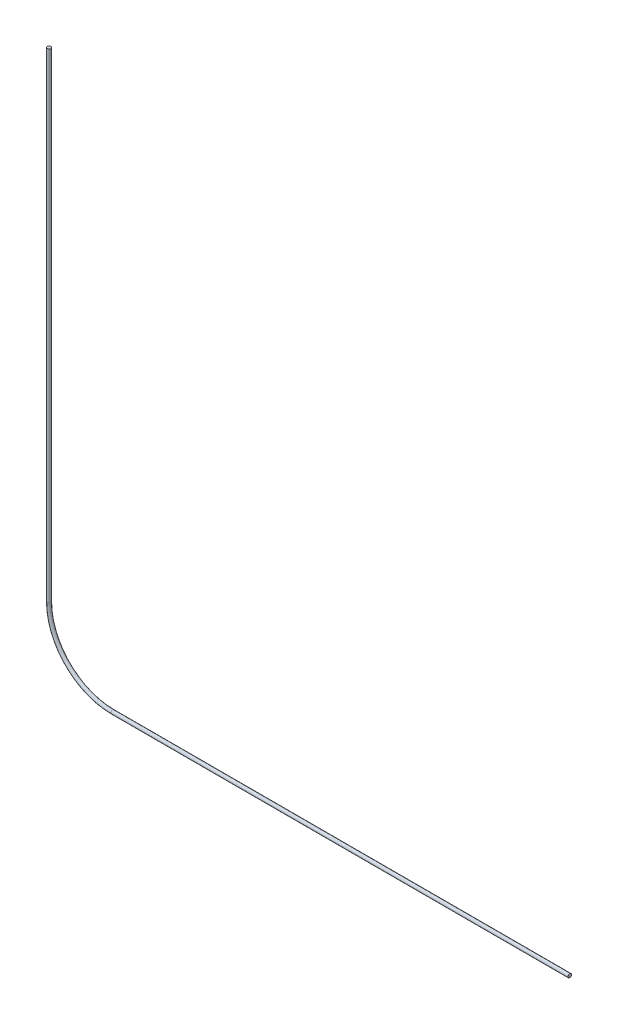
ISO-10303-21;
HEADER;
FILE_DESCRIPTION(('STEP AP214'),'2;1');
FILE_NAME('part.step','',(''),(''),'','','');
FILE_SCHEMA(('AUTOMOTIVE_DESIGN { 1 0 10303 214 1 1 1 1 }'));
ENDSEC;
DATA;
#1=APPLICATION_CONTEXT('core data for automotive mechanical design processes');
#2=APPLICATION_PROTOCOL_DEFINITION('international standard','automotive_design',2000,#1);
#3=PRODUCT_CONTEXT('',#1,'mechanical');
#4=PRODUCT('Part','Part','',(#3));
#5=PRODUCT_RELATED_PRODUCT_CATEGORY('part','',(#4));
#6=PRODUCT_DEFINITION_FORMATION('','',#4);
#7=PRODUCT_DEFINITION_CONTEXT('part definition',#1,'design');
#8=PRODUCT_DEFINITION('design','',#6,#7);
#9=PRODUCT_DEFINITION_SHAPE('','',#8);
#10=(LENGTH_UNIT() NAMED_UNIT(*) SI_UNIT(.MILLI.,.METRE.));
#11=(NAMED_UNIT(*) PLANE_ANGLE_UNIT() SI_UNIT($,.RADIAN.));
#12=(NAMED_UNIT(*) SI_UNIT($,.STERADIAN.) SOLID_ANGLE_UNIT());
#13=UNCERTAINTY_MEASURE_WITH_UNIT(LENGTH_MEASURE(1.E-05),#10,'distance_accuracy_value','');
#14=(GEOMETRIC_REPRESENTATION_CONTEXT(3) GLOBAL_UNCERTAINTY_ASSIGNED_CONTEXT((#13)) GLOBAL_UNIT_ASSIGNED_CONTEXT((#10,
#11,#12)) REPRESENTATION_CONTEXT('',''));
#15=CARTESIAN_POINT('',(0.,0.,0.));
#16=DIRECTION('',(0.,0.,1.));
#17=DIRECTION('',(1.,0.,0.));
#18=AXIS2_PLACEMENT_3D('',#15,#16,#17);
#19=CARTESIAN_POINT('',(0.,0.,0.));
#20=DIRECTION('',(1.,0.,0.));
#21=DIRECTION('',(0.,0.,-1.));
#22=AXIS2_PLACEMENT_3D('',#19,#20,#21);
#23=PLANE('',#22);
#24=CARTESIAN_POINT('',(0.,0.,0.));
#25=DIRECTION('',(1.,0.,0.));
#26=DIRECTION('',(0.,0.,-1.));
#27=AXIS2_PLACEMENT_3D('',#24,#25,#26);
#28=CIRCLE('',#27,0.18);
#29=CARTESIAN_POINT('',(0.,0.,-0.18));
#30=VERTEX_POINT('',#29);
#31=EDGE_CURVE('E56',#30,#30,#28,.T.);
#32=ORIENTED_EDGE('',*,*,#31,.T.);
#33=EDGE_LOOP('',(#32));
#34=FACE_BOUND('',#33,.T.);
#35=ADVANCED_FACE('F41',(#34),#23,.T.);
#36=CARTESIAN_POINT('',(-52.0624999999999,54.3502916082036,0.));
#37=DIRECTION('',(0.,-1.,0.));
#38=DIRECTION('',(0.,0.,-1.));
#39=AXIS2_PLACEMENT_3D('',#36,#37,#38);
#40=PLANE('',#39);
#41=CARTESIAN_POINT('',(-52.0624999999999,54.3502916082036,0.));
#42=DIRECTION('',(0.,-1.,0.));
#43=DIRECTION('',(0.,0.,-1.));
#44=AXIS2_PLACEMENT_3D('',#41,#42,#43);
#45=CIRCLE('',#44,0.18);
#46=CARTESIAN_POINT('',(-52.0624999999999,54.3502916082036,-0.18));
#47=VERTEX_POINT('',#46);
#48=EDGE_CURVE('E11',#47,#47,#45,.T.);
#49=ORIENTED_EDGE('',*,*,#48,.F.);
#50=EDGE_LOOP('',(#49));
#51=FACE_BOUND('',#50,.T.);
#52=ADVANCED_FACE('F62',(#51),#40,.F.);
#53=CARTESIAN_POINT('',(0.,0.,0.));
#54=DIRECTION('',(-1.,0.,0.));
#55=DIRECTION('',(0.,-1.,0.));
#56=AXIS2_PLACEMENT_3D('',#53,#54,#55);
#57=CYLINDRICAL_SURFACE('',#56,0.18);
#58=CARTESIAN_POINT('',(-45.6999999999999,0.,0.));
#59=DIRECTION('',(1.,0.,0.));
#60=DIRECTION('',(0.,0.,-1.));
#61=AXIS2_PLACEMENT_3D('',#58,#59,#60);
#62=CIRCLE('',#61,0.18);
#63=CARTESIAN_POINT('',(-45.6999999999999,-0.180000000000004,0.));
#64=VERTEX_POINT('',#63);
#65=EDGE_CURVE('E87',#64,#64,#62,.T.);
#66=ORIENTED_EDGE('',*,*,#65,.T.);
#67=EDGE_LOOP('',(#66));
#68=FACE_BOUND('',#67,.T.);
#69=ORIENTED_EDGE('',*,*,#31,.F.);
#70=EDGE_LOOP('',(#69));
#71=FACE_BOUND('',#70,.T.);
#72=ADVANCED_FACE('F64',(#68,#71),#57,.T.);
#73=CARTESIAN_POINT('',(-45.6999999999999,6.36249999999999,0.));
#74=DIRECTION('',(0.,0.,-1.));
#75=DIRECTION('',(-1.,0.,0.));
#76=AXIS2_PLACEMENT_3D('',#73,#74,#75);
#77=TOROIDAL_SURFACE('',#76,6.36249999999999,0.18);
#78=CARTESIAN_POINT('',(-52.0624999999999,6.36249999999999,0.));
#79=DIRECTION('',(0.,-1.,0.));
#80=DIRECTION('',(0.,0.,-1.));
#81=AXIS2_PLACEMENT_3D('',#78,#79,#80);
#82=CIRCLE('',#81,0.18);
#83=CARTESIAN_POINT('',(-52.2424999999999,6.36249999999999,0.));
#84=VERTEX_POINT('',#83);
#85=EDGE_CURVE('E49',#84,#84,#82,.T.);
#86=CARTESIAN_POINT('',(-45.6999999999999,6.36249999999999,0.));
#87=DIRECTION('',(0.,0.,-1.));
#88=DIRECTION('',(-1.,0.,0.));
#89=AXIS2_PLACEMENT_3D('',#86,#87,#88);
#90=CIRCLE('',#89,6.54249999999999);
#91=EDGE_CURVE('',#64,#84,#90,.T.);
#92=ORIENTED_EDGE('',*,*,#65,.F.);
#93=ORIENTED_EDGE('',*,*,#85,.T.);
#94=ORIENTED_EDGE('',*,*,#91,.T.);
#95=ORIENTED_EDGE('',*,*,#91,.F.);
#96=EDGE_LOOP('',(#92,#94,#93,#95));
#97=FACE_BOUND('',#96,.T.);
#98=ADVANCED_FACE('F69',(#97),#77,.T.);
#99=CARTESIAN_POINT('',(-52.0624999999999,6.36249999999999,0.));
#100=DIRECTION('',(0.,1.,0.));
#101=DIRECTION('',(0.,0.,1.));
#102=AXIS2_PLACEMENT_3D('',#99,#100,#101);
#103=CYLINDRICAL_SURFACE('',#102,0.18);
#104=ORIENTED_EDGE('',*,*,#48,.T.);
#105=EDGE_LOOP('',(#104));
#106=FACE_BOUND('',#105,.T.);
#107=ORIENTED_EDGE('',*,*,#85,.F.);
#108=EDGE_LOOP('',(#107));
#109=FACE_BOUND('',#108,.T.);
#110=ADVANCED_FACE('F59',(#106,#109),#103,.T.);
#111=CLOSED_SHELL('',(#35,#52,#72,#98,#110));
#112=MANIFOLD_SOLID_BREP('B2',#111);
#113=ADVANCED_BREP_SHAPE_REPRESENTATION('',(#18,#112),#14);
#114=SHAPE_DEFINITION_REPRESENTATION(#9,#113);
ENDSEC;
END-ISO-10303-21;
